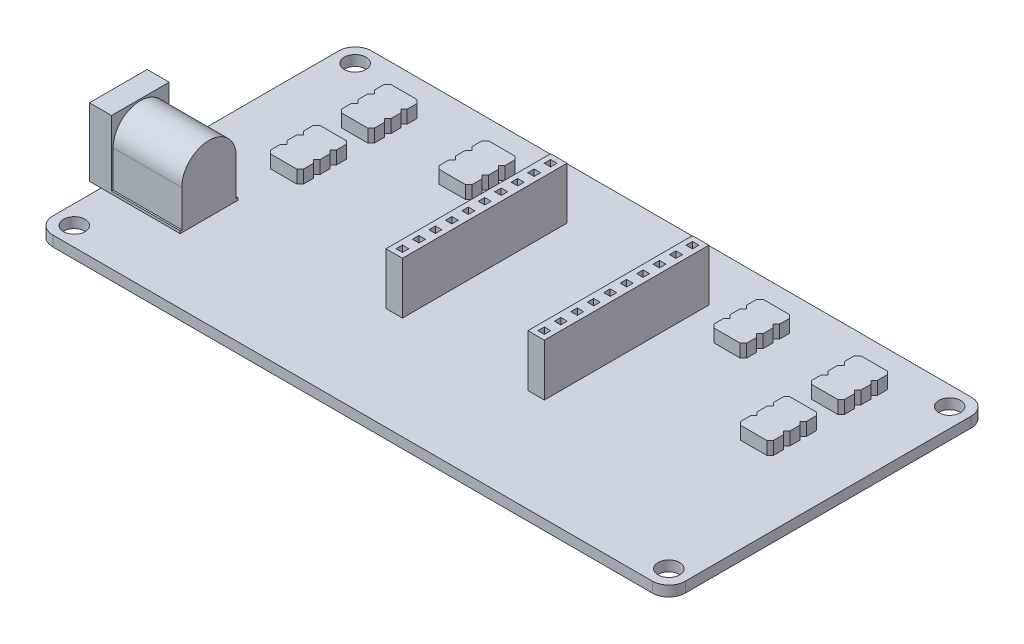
from build123d import *

# Parameters (mm, degrees)
BOSS_EXTRUDE1_DEPTH = 1.6
SKETCH2_W           = 14
SKETCH2_H           = 8.9
BOSS_EXTRUDE2_DEPTH = 10.5
BOSS_EXTRUDE3_DEPTH = 2
CUT_EXTRUDE1_DEPTH  = 10.6
FILLET1_RADIUS      = 4.2
FILLET1_LENGTH      = 10.6
SKETCH6_W           = 2.54
SKETCH6_H           = 25.4
SKETCH6_W_2         = 1
SKETCH6_H_2         = 1
BOSS_EXTRUDE4_DEPTH = 8
SKETCH7_R           = 1.6637
CUT_EXTRUDE2_DEPTH  = 58.250843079


with BuildPart() as part:
    # Sketch1 → Boss-Extrude1 (new body)
    with BuildSketch(Plane(origin=(0, 0, 0), x_dir=(1, 0, 0), z_dir=(0, 1, 0))):
        with BuildLine():
            Line((-46.275625, -24.60625), (46.275625, -24.60625))
            ThreePointArc((46.275625, -24.60625), (48.071676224, -23.862301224), (48.815625, -22.06625))
            Line((48.815625, -22.06625), (48.815625, 22.06625))
            ThreePointArc((48.815625, 22.06625), (48.071676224, 23.862301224), (46.275625, 24.60625))
            Line((46.275625, 24.60625), (-46.275625, 24.60625))
            ThreePointArc((-46.275625, 24.60625), (-48.071676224, 23.862301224), (-48.815625, 22.06625))
            Line((-48.815625, 22.06625), (-48.815625, -22.06625))
            ThreePointArc((-48.815625, -22.06625), (-48.071676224, -23.862301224), (-46.275625, -24.60625))
        make_face()
    extrude(amount=BOSS_EXTRUDE1_DEPTH)

    # Sketch2 → Boss-Extrude2 (add)
    with BuildSketch(Plane(origin=(0, 1.6, 0), x_dir=(1, 0, 0), z_dir=(0, 1, 0))):
        with Locations((-43.615625, -10.15625)):
            Rectangle(SKETCH2_W, SKETCH2_H)
    extrude(amount=BOSS_EXTRUDE2_DEPTH)

    # Sketch3 → Boss-Extrude3 (add)
    with BuildSketch(Plane(origin=(0, 1.6, 0), x_dir=(1, 0, 0), z_dir=(0, 1, 0))):
        Polygon((-23.235625, 19.60625), (-23.735625, 19.10625), (-23.735625, 17.56625), (-23.235625, 17.06625), (-23.735625, 16.56625), (-23.735625, 15.02625), (-23.235625, 14.52625), (-23.735625, 14.02625), (-23.735625, 12.48625), (-23.235625, 11.98625), (-19.155625, 11.98625), (-18.655625, 12.48625), (-18.655625, 14.02625), (-19.155625, 14.52625), (-18.655625, 15.02625), (-18.655625, 16.56625), (-19.155625, 17.06625), (-18.655625, 17.56625), (-18.655625, 19.10625), (-19.155625, 19.60625), align=None)
        Polygon((-38.315625, 19.60625), (-38.815625, 19.10625), (-38.815625, 17.56625), (-38.315625, 17.06625), (-38.815625, 16.56625), (-38.815625, 15.02625), (-38.315625, 14.52625), (-38.815625, 14.02625), (-38.815625, 12.48625), (-38.315625, 11.98625), (-34.235625, 11.98625), (-33.735625, 12.48625), (-33.735625, 14.02625), (-34.235625, 14.52625), (-33.735625, 15.02625), (-33.735625, 16.56625), (-34.235625, 17.06625), (-33.735625, 17.56625), (-33.735625, 19.10625), (-34.235625, 19.60625), align=None)
        Polygon((-38.315625, 8.652916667), (-38.815625, 8.152916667), (-38.815625, 6.612916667), (-38.315625, 6.112916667), (-38.815625, 5.612916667), (-38.815625, 4.072916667), (-38.315625, 3.572916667), (-38.815625, 3.072916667), (-38.815625, 1.532916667), (-38.315625, 1.032916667), (-34.235625, 1.032916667), (-33.735625, 1.532916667), (-33.735625, 3.072916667), (-34.235625, 3.572916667), (-33.735625, 4.072916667), (-33.735625, 5.612916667), (-34.235625, 6.112916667), (-33.735625, 6.612916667), (-33.735625, 8.152916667), (-34.235625, 8.652916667), align=None)
    boss_extrude3 = extrude(amount=BOSS_EXTRUDE3_DEPTH)

    # Mirror1: Boss-Extrude3 across plane
    add(boss_extrude3.mirror(Plane(origin=(0, 0, 0), x_dir=(0, 0, 1), z_dir=(1, 0, 0))))

    # Sketch5 → Cut-Extrude1 (cut)
    with BuildSketch(Plane(origin=(-36.615625, 0, 0), x_dir=(0, 0, -1), z_dir=(1, 0, 0))):
        Polygon((-14.35625, 2), (-14.35625, 11.85), (-5.95625, 11.85), (-5.95625, 2), (-5.70625, 2), (-5.70625, 12.1), (-14.60625, 12.1), (-14.60625, 2), align=None)
    extrude(amount=-CUT_EXTRUDE1_DEPTH, mode=Mode.SUBTRACT)

    # Fillet1: full round fillet: the end face becomes a half cylinder, R = half its width
    fillet1_face = Plane((-41.915625, 11.85, 10.15625), x_dir=(-1, 0, 0), z_dir=(0, 1, 0))  # on the end face: x along it, z out of the body
    fillet1_slab = fillet1_face.offset(-FILLET1_RADIUS / 2) * Box(FILLET1_LENGTH, 2 * FILLET1_RADIUS, FILLET1_RADIUS, mode=Mode.PRIVATE)  # the body's end, R deep
    fillet1_round = Plane((-41.915625, 7.65, 10.15625), x_dir=(0, 1, 0), z_dir=(-1, 0, 0)) * Cylinder(FILLET1_RADIUS, FILLET1_LENGTH, mode=Mode.PRIVATE)  # its axis R under the face
    add(fillet1_slab - fillet1_round, mode=Mode.SUBTRACT)

    # Sketch6 → Boss-Extrude4 (add)
    # profile 1 of 2: a face of its own
    with BuildSketch(Plane(origin=(0, 1.6, 0), x_dir=(1, 0, 0), z_dir=(0, 1, 0))):
        with Locations((-9.445625, 3.96875)):
            Rectangle(SKETCH6_W, SKETCH6_H)
        with Locations((-9.445625, 12.85875)):
            Rectangle(SKETCH6_W_2, SKETCH6_H_2, mode=Mode.SUBTRACT)
        with Locations((-9.445625, 15.39875)):
            Rectangle(SKETCH6_W_2, SKETCH6_H_2, mode=Mode.SUBTRACT)
        with Locations((-9.445625, 10.31875)):
            Rectangle(SKETCH6_W_2, SKETCH6_H_2, mode=Mode.SUBTRACT)
        with Locations((-9.445625, 7.77875)):
            Rectangle(SKETCH6_W_2, SKETCH6_H_2, mode=Mode.SUBTRACT)
        with Locations((-9.445625, 5.23875)):
            Rectangle(SKETCH6_W_2, SKETCH6_H_2, mode=Mode.SUBTRACT)
        with Locations((-9.445625, 2.69875)):
            Rectangle(SKETCH6_W_2, SKETCH6_H_2, mode=Mode.SUBTRACT)
        with Locations((-9.445625, 0.15875)):
            Rectangle(SKETCH6_W_2, SKETCH6_H_2, mode=Mode.SUBTRACT)
        with Locations((-9.445625, -2.38125)):
            Rectangle(SKETCH6_W_2, SKETCH6_H_2, mode=Mode.SUBTRACT)
        with Locations((-9.445625, -4.92125)):
            Rectangle(SKETCH6_W_2, SKETCH6_H_2, mode=Mode.SUBTRACT)
        with Locations((-9.445625, -7.46125)):
            Rectangle(SKETCH6_W_2, SKETCH6_H_2, mode=Mode.SUBTRACT)
    # profile 2 of 2: a face of its own
    with BuildSketch(Plane(origin=(0, 1.6, 0), x_dir=(1, 0, 0), z_dir=(0, 1, 0))):
        with Locations((12.454375, 3.96875)):
            Rectangle(SKETCH6_W, SKETCH6_H)
        with Locations((12.454375, 12.85875)):
            Rectangle(SKETCH6_W_2, SKETCH6_H_2, mode=Mode.SUBTRACT)
        with Locations((12.454375, 15.39875)):
            Rectangle(SKETCH6_W_2, SKETCH6_H_2, mode=Mode.SUBTRACT)
        with Locations((12.454375, 10.31875)):
            Rectangle(SKETCH6_W_2, SKETCH6_H_2, mode=Mode.SUBTRACT)
        with Locations((12.454375, 7.77875)):
            Rectangle(SKETCH6_W_2, SKETCH6_H_2, mode=Mode.SUBTRACT)
        with Locations((12.454375, 5.23875)):
            Rectangle(SKETCH6_W_2, SKETCH6_H_2, mode=Mode.SUBTRACT)
        with Locations((12.454375, 2.69875)):
            Rectangle(SKETCH6_W_2, SKETCH6_H_2, mode=Mode.SUBTRACT)
        with Locations((12.454375, 0.15875)):
            Rectangle(SKETCH6_W_2, SKETCH6_H_2, mode=Mode.SUBTRACT)
        with Locations((12.454375, -2.38125)):
            Rectangle(SKETCH6_W_2, SKETCH6_H_2, mode=Mode.SUBTRACT)
        with Locations((12.454375, -4.92125)):
            Rectangle(SKETCH6_W_2, SKETCH6_H_2, mode=Mode.SUBTRACT)
        with Locations((12.454375, -7.46125)):
            Rectangle(SKETCH6_W_2, SKETCH6_H_2, mode=Mode.SUBTRACT)
    extrude(amount=BOSS_EXTRUDE4_DEPTH)

    # Sketch7 → Cut-Extrude2 (cut, through all)
    with BuildSketch(Plane(origin=(0, 1.6, 0), x_dir=(1, 0, 0), z_dir=(0, 1, 0))):
        with Locations(Location((-45.881925, 21.67255, 0), (0, 0, 270))):
            Circle(SKETCH7_R)
        with Locations(Location((-45.881925, -21.67255, 0), (0, 0, 270))):
            Circle(SKETCH7_R)
        with Locations(Location((45.881925, -21.67255, 0), (0, 0, 270))):
            Circle(SKETCH7_R)
        with Locations(Location((45.881925, 21.67255, 0), (0, 0, 270))):
            Circle(SKETCH7_R)
    extrude(amount=-CUT_EXTRUDE2_DEPTH, mode=Mode.SUBTRACT)


solid = part.part
